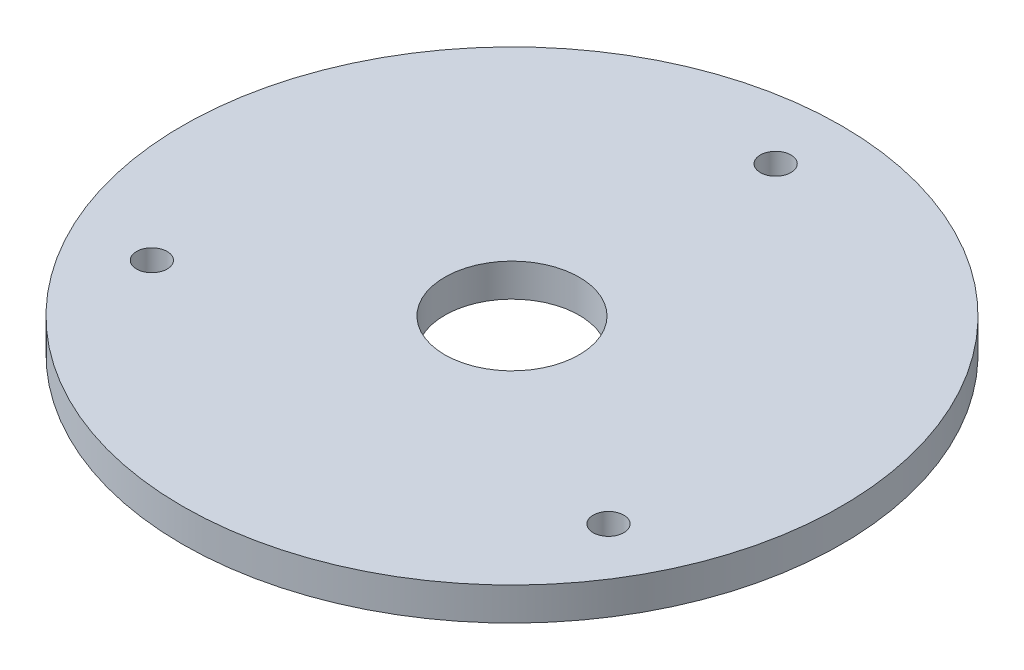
from build123d import *

# Parameters (mm, degrees)
SKETCH1_R           = 31.75
SKETCH1_R_2         = 6.477
BOSS_EXTRUDE1_DEPTH = 3.175
SKETCH2_R           = 1.4732
CUT_EXTRUDE1_DEPTH  = 46.01339384


with BuildPart() as part:
    # Sketch1 → Boss-Extrude1 (new body)
    with BuildSketch(Plane(origin=(0, 0, 0), x_dir=(1, 0, 0), z_dir=(0, 1, 0))):
        with Locations(Location((0, 0, 0), (0, 0, 270))):
            Circle(SKETCH1_R)
        with Locations(Location((0, 0, 0), (0, 0, 270))):
            Circle(SKETCH1_R_2, mode=Mode.SUBTRACT)
    extrude(amount=BOSS_EXTRUDE1_DEPTH)

    # Sketch2 → Cut-Extrude1 (cut, through all)
    with BuildSketch(Plane(origin=(0, 3.175, 0), x_dir=(1, 0, 0), z_dir=(0, 1, 0))):
        with Locations(Location((0, 25.4, 0), (0, 0, 270))):
            Circle(SKETCH2_R)
        with Locations(Location((21.997045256, -12.7, 0), (0, 0, 270))):
            Circle(SKETCH2_R)
        with Locations(Location((-21.997045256, -12.7, 0), (0, 0, 270))):
            Circle(SKETCH2_R)
    extrude(amount=-CUT_EXTRUDE1_DEPTH, mode=Mode.SUBTRACT)


solid = part.part
